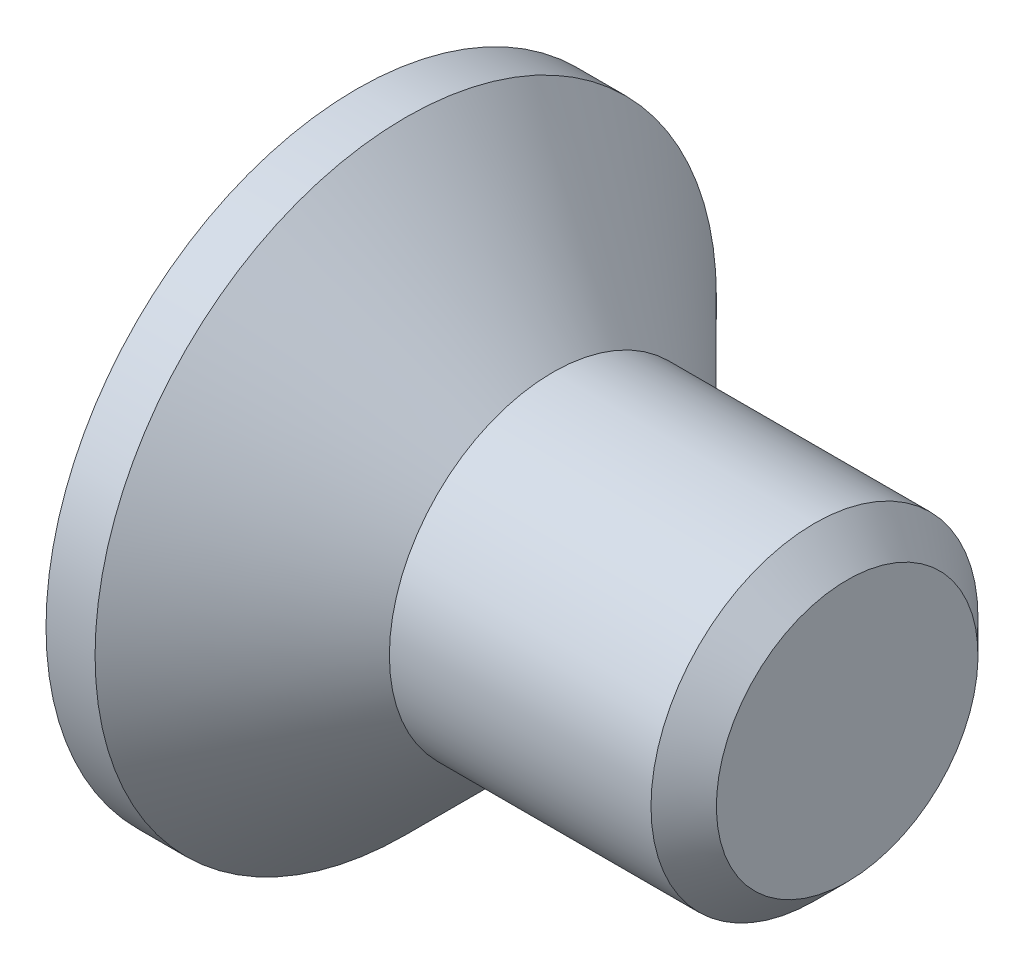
from build123d import *

# Parameters (mm, degrees)
CHAMFER1_SIZE      = 0.2
CUT_EXTRUDE1_DEPTH = 0.95


with BuildPart() as part:
    # Sketch1 → Revolve1 (revolve)
    with BuildSketch(Plane.XY, mode=Mode.PRIVATE) as revolve1_sk:
        Polygon((-1.2, 1.9), (-1.2, 0), (1.8, 0), (1.8, 1), (0, 1), (-0.9, 1.9), align=None)
    revolve(revolve1_sk.sketch.rotate(Axis((-1.2, 0, 0), (1, 0, 0)), 180), axis=Axis((-1.2, 0, 0), (1, 0, 0)))

    # Chamfer1
    chamfer1_edges = [part.edges().sort_by_distance(p)[0] for p in [
        (1.8, 1, 0),
    ]]
    chamfer(chamfer1_edges, length=CHAMFER1_SIZE)

    # Sketch2 → Cut-Extrude1 (cut)
    with BuildSketch(Plane.ZY.offset(1.2)):
        Polygon((-0.3, 1.175), (0.3, 1.175), (0.3, 0.3), (1.175, 0.3), (1.175, -0.3), (0.3, -0.3), (0.3, -1.175), (-0.3, -1.175), (-0.3, -0.3), (-1.175, -0.3), (-1.175, 0.3), (-0.3, 0.3), align=None)
    extrude(amount=-CUT_EXTRUDE1_DEPTH, mode=Mode.SUBTRACT)


solid = part.part
